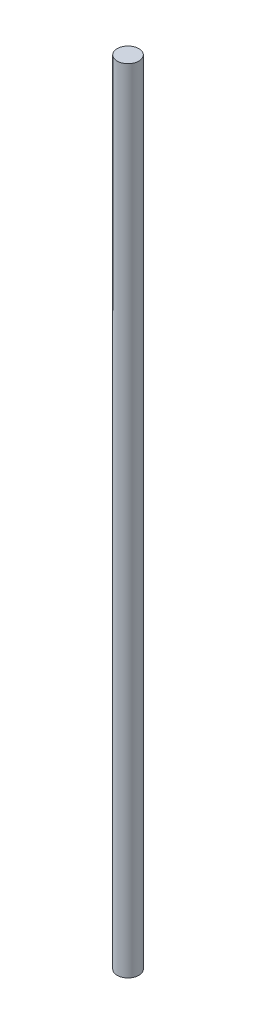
from build123d import *

# Parameters (mm, degrees)
SKETCH1_R           = 5
BOSS_EXTRUDE1_DEPTH = 365.6


with BuildPart() as part:
    # Sketch1 → Boss-Extrude1 (new body)
    with BuildSketch(Plane(origin=(0, 0, 0), x_dir=(1, 0, 0), z_dir=(0, 1, 0))):
        with Locations(Location((0, 0, 0), (0, 0, 90))):
            Circle(SKETCH1_R)
    extrude(amount=BOSS_EXTRUDE1_DEPTH)


solid = part.part
